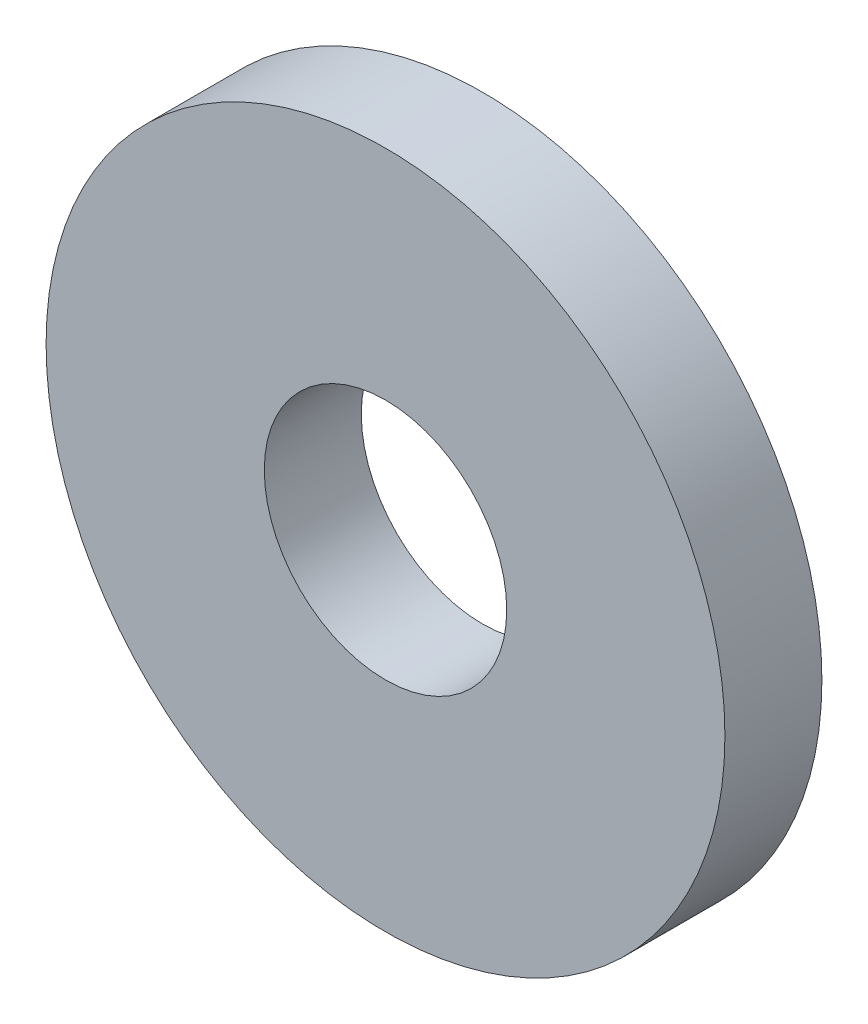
from build123d import *

# Parameters (mm, degrees)
BODYFV_W   = 17.5
BODYFV_H   = 5
THRUHLFV_W = 6.25
THRUHLFV_H = 5


with BuildPart() as part:
    # BodyFV → Revolve1 (revolve)
    with BuildSketch(Plane(origin=(0, 0, 0), x_dir=(1, 0, 0), z_dir=(0, 1, 0)), mode=Mode.PRIVATE) as revolve1_sk:
        with Locations((8.75, 2.5)):
            Rectangle(BODYFV_W, BODYFV_H)
    revolve(revolve1_sk.sketch.rotate(Axis((0, 0, 0), (0, 0, 1)), 180), axis=Axis((0, 0, 0), (0, 0, 1)))

    # ThruHlFV → Thru Hole (revolve, cut)
    with BuildSketch(Plane(origin=(0, 0, 0), x_dir=(1, 0, 0), z_dir=(0, 1, 0)), mode=Mode.PRIVATE) as thru_hole_sk:
        with Locations((3.125, 2.5)):
            Rectangle(THRUHLFV_W, THRUHLFV_H)
    revolve(thru_hole_sk.sketch.rotate(Axis((0, 0, 0), (0, 0, 1)), 180), axis=Axis((0, 0, 0), (0, 0, 1)), mode=Mode.SUBTRACT)


solid = part.part
